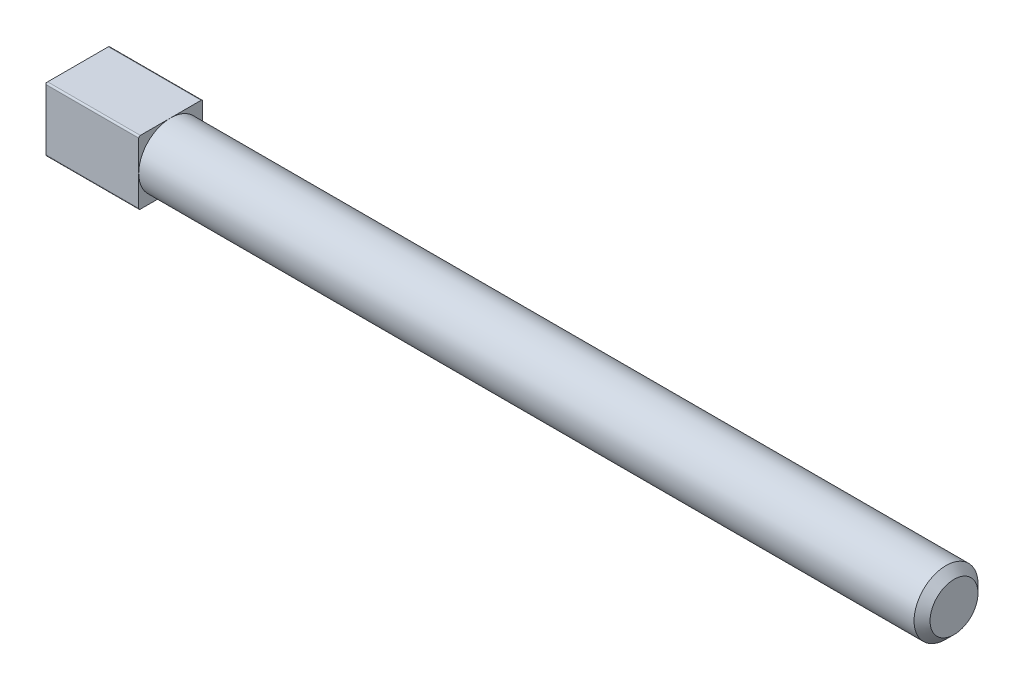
ISO-10303-21;
HEADER;
FILE_DESCRIPTION(('STEP AP214'),'2;1');
FILE_NAME('part.step','',(''),(''),'','','');
FILE_SCHEMA(('AUTOMOTIVE_DESIGN { 1 0 10303 214 1 1 1 1 }'));
ENDSEC;
DATA;
#1=APPLICATION_CONTEXT('core data for automotive mechanical design processes');
#2=APPLICATION_PROTOCOL_DEFINITION('international standard','automotive_design',2000,#1);
#3=PRODUCT_CONTEXT('',#1,'mechanical');
#4=PRODUCT('Part','Part','',(#3));
#5=PRODUCT_RELATED_PRODUCT_CATEGORY('part','',(#4));
#6=PRODUCT_DEFINITION_FORMATION('','',#4);
#7=PRODUCT_DEFINITION_CONTEXT('part definition',#1,'design');
#8=PRODUCT_DEFINITION('design','',#6,#7);
#9=PRODUCT_DEFINITION_SHAPE('','',#8);
#10=(LENGTH_UNIT() NAMED_UNIT(*) SI_UNIT(.MILLI.,.METRE.));
#11=(NAMED_UNIT(*) PLANE_ANGLE_UNIT() SI_UNIT($,.RADIAN.));
#12=(NAMED_UNIT(*) SI_UNIT($,.STERADIAN.) SOLID_ANGLE_UNIT());
#13=UNCERTAINTY_MEASURE_WITH_UNIT(LENGTH_MEASURE(1.E-05),#10,'distance_accuracy_value','');
#14=(GEOMETRIC_REPRESENTATION_CONTEXT(3) GLOBAL_UNCERTAINTY_ASSIGNED_CONTEXT((#13)) GLOBAL_UNIT_ASSIGNED_CONTEXT((#10,
#11,#12)) REPRESENTATION_CONTEXT('',''));
#15=CARTESIAN_POINT('',(0.,0.,0.));
#16=DIRECTION('',(0.,0.,1.));
#17=DIRECTION('',(1.,0.,0.));
#18=AXIS2_PLACEMENT_3D('',#15,#16,#17);
#19=CARTESIAN_POINT('',(6.,0.,0.));
#20=DIRECTION('',(-1.,0.,0.));
#21=DIRECTION('',(0.,0.,1.));
#22=AXIS2_PLACEMENT_3D('',#19,#20,#21);
#23=PLANE('',#22);
#24=DIRECTION('',(0.,1.,0.));
#25=VECTOR('',#24,1.);
#26=CARTESIAN_POINT('',(6.,-2.,-2.));
#27=LINE('',#26,#25);
#28=CARTESIAN_POINT('',(6.,0.,-2.));
#29=VERTEX_POINT('',#28);
#30=CARTESIAN_POINT('',(6.,1.9,-2.));
#31=VERTEX_POINT('',#30);
#32=EDGE_CURVE('E149',#29,#31,#27,.T.);
#33=ORIENTED_EDGE('',*,*,#32,.T.);
#34=CARTESIAN_POINT('',(6.,1.9,-1.9));
#35=DIRECTION('',(-1.,0.,0.));
#36=DIRECTION('',(0.,0.,1.));
#37=AXIS2_PLACEMENT_3D('',#34,#35,#36);
#38=CIRCLE('',#37,0.1);
#39=CARTESIAN_POINT('',(6.,2.,-1.9));
#40=VERTEX_POINT('',#39);
#41=EDGE_CURVE('E232',#31,#40,#38,.F.);
#42=ORIENTED_EDGE('',*,*,#41,.T.);
#43=DIRECTION('',(0.,0.,1.));
#44=VECTOR('',#43,1.);
#45=CARTESIAN_POINT('',(6.,2.,-2.));
#46=LINE('',#45,#44);
#47=CARTESIAN_POINT('',(6.,2.,0.));
#48=VERTEX_POINT('',#47);
#49=EDGE_CURVE('E163',#40,#48,#46,.T.);
#50=ORIENTED_EDGE('',*,*,#49,.T.);
#51=CARTESIAN_POINT('',(6.,0.,0.));
#52=DIRECTION('',(1.,0.,0.));
#53=DIRECTION('',(0.,0.,-1.));
#54=AXIS2_PLACEMENT_3D('',#51,#52,#53);
#55=CIRCLE('',#54,2.);
#56=EDGE_CURVE('E161',#29,#48,#55,.T.);
#57=ORIENTED_EDGE('',*,*,#56,.F.);
#58=EDGE_LOOP('',(#33,#42,#50,#57));
#59=FACE_BOUND('',#58,.T.);
#60=ADVANCED_FACE('F34',(#59),#23,.F.);
#61=CARTESIAN_POINT('',(6.,2.,1.9));
#62=VERTEX_POINT('',#61);
#63=EDGE_CURVE('E148',#48,#62,#46,.T.);
#64=ORIENTED_EDGE('',*,*,#63,.T.);
#65=CARTESIAN_POINT('',(6.,1.9,1.9));
#66=DIRECTION('',(-1.,0.,0.));
#67=DIRECTION('',(0.,0.,1.));
#68=AXIS2_PLACEMENT_3D('',#65,#66,#67);
#69=CIRCLE('',#68,0.1);
#70=CARTESIAN_POINT('',(6.,1.9,2.));
#71=VERTEX_POINT('',#70);
#72=EDGE_CURVE('E11',#62,#71,#69,.F.);
#73=ORIENTED_EDGE('',*,*,#72,.T.);
#74=DIRECTION('',(0.,-1.,0.));
#75=VECTOR('',#74,1.);
#76=CARTESIAN_POINT('',(6.,-2.,2.));
#77=LINE('',#76,#75);
#78=CARTESIAN_POINT('',(6.,0.,2.));
#79=VERTEX_POINT('',#78);
#80=EDGE_CURVE('E175',#71,#79,#77,.T.);
#81=ORIENTED_EDGE('',*,*,#80,.T.);
#82=EDGE_CURVE('E170',#48,#79,#55,.T.);
#83=ORIENTED_EDGE('',*,*,#82,.F.);
#84=EDGE_LOOP('',(#64,#73,#81,#83));
#85=FACE_BOUND('',#84,.T.);
#86=ADVANCED_FACE('F293',(#85),#23,.F.);
#87=CARTESIAN_POINT('',(6.,-1.9,2.));
#88=VERTEX_POINT('',#87);
#89=EDGE_CURVE('E176',#79,#88,#77,.T.);
#90=ORIENTED_EDGE('',*,*,#89,.T.);
#91=CARTESIAN_POINT('',(6.,-1.9,1.9));
#92=DIRECTION('',(-1.,0.,0.));
#93=DIRECTION('',(0.,0.,1.));
#94=AXIS2_PLACEMENT_3D('',#91,#92,#93);
#95=CIRCLE('',#94,0.1);
#96=CARTESIAN_POINT('',(6.,-2.,1.9));
#97=VERTEX_POINT('',#96);
#98=EDGE_CURVE('E42',#88,#97,#95,.F.);
#99=ORIENTED_EDGE('',*,*,#98,.T.);
#100=DIRECTION('',(0.,0.,-1.));
#101=VECTOR('',#100,1.);
#102=CARTESIAN_POINT('',(6.,-2.,-2.));
#103=LINE('',#102,#101);
#104=CARTESIAN_POINT('',(6.,-2.,0.));
#105=VERTEX_POINT('',#104);
#106=EDGE_CURVE('E159',#97,#105,#103,.T.);
#107=ORIENTED_EDGE('',*,*,#106,.T.);
#108=EDGE_CURVE('E174',#79,#105,#55,.T.);
#109=ORIENTED_EDGE('',*,*,#108,.F.);
#110=EDGE_LOOP('',(#90,#99,#107,#109));
#111=FACE_BOUND('',#110,.T.);
#112=ADVANCED_FACE('F254',(#111),#23,.F.);
#113=CARTESIAN_POINT('',(6.,-2.,-1.9));
#114=VERTEX_POINT('',#113);
#115=EDGE_CURVE('E167',#105,#114,#103,.T.);
#116=ORIENTED_EDGE('',*,*,#115,.T.);
#117=CARTESIAN_POINT('',(6.,-1.9,-1.9));
#118=DIRECTION('',(-1.,0.,0.));
#119=DIRECTION('',(0.,0.,1.));
#120=AXIS2_PLACEMENT_3D('',#117,#118,#119);
#121=CIRCLE('',#120,0.1);
#122=CARTESIAN_POINT('',(6.,-1.9,-2.));
#123=VERTEX_POINT('',#122);
#124=EDGE_CURVE('E144',#114,#123,#121,.F.);
#125=ORIENTED_EDGE('',*,*,#124,.T.);
#126=EDGE_CURVE('E136',#123,#29,#27,.T.);
#127=ORIENTED_EDGE('',*,*,#126,.T.);
#128=EDGE_CURVE('E141',#105,#29,#55,.T.);
#129=ORIENTED_EDGE('',*,*,#128,.F.);
#130=EDGE_LOOP('',(#116,#125,#127,#129));
#131=FACE_BOUND('',#130,.T.);
#132=ADVANCED_FACE('F139',(#131),#23,.F.);
#133=CARTESIAN_POINT('',(6.,-2.,-2.));
#134=DIRECTION('',(0.,1.,0.));
#135=DIRECTION('',(0.,0.,1.));
#136=AXIS2_PLACEMENT_3D('',#133,#134,#135);
#137=PLANE('',#136);
#138=DIRECTION('',(0.,0.,-1.));
#139=VECTOR('',#138,1.);
#140=CARTESIAN_POINT('',(0.199999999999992,-2.,-2.));
#141=LINE('',#140,#139);
#142=CARTESIAN_POINT('',(0.199999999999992,-2.,1.9));
#143=VERTEX_POINT('',#142);
#144=CARTESIAN_POINT('',(0.199999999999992,-2.,-1.9));
#145=VERTEX_POINT('',#144);
#146=EDGE_CURVE('E204',#143,#145,#141,.T.);
#147=ORIENTED_EDGE('',*,*,#146,.T.);
#148=DIRECTION('',(-1.,0.,0.));
#149=VECTOR('',#148,1.);
#150=CARTESIAN_POINT('',(6.,-2.,-1.9));
#151=LINE('',#150,#149);
#152=EDGE_CURVE('E241',#145,#114,#151,.F.);
#153=ORIENTED_EDGE('',*,*,#152,.T.);
#154=ORIENTED_EDGE('',*,*,#115,.F.);
#155=ORIENTED_EDGE('',*,*,#106,.F.);
#156=DIRECTION('',(-1.,0.,0.));
#157=VECTOR('',#156,1.);
#158=CARTESIAN_POINT('',(6.,-2.,1.9));
#159=LINE('',#158,#157);
#160=EDGE_CURVE('E238',#97,#143,#159,.T.);
#161=ORIENTED_EDGE('',*,*,#160,.T.);
#162=EDGE_LOOP('',(#147,#153,#154,#155,#161));
#163=FACE_BOUND('',#162,.T.);
#164=ADVANCED_FACE('F258',(#163),#137,.F.);
#165=CARTESIAN_POINT('',(6.,-2.,-2.));
#166=DIRECTION('',(0.,0.,1.));
#167=DIRECTION('',(0.,-1.,0.));
#168=AXIS2_PLACEMENT_3D('',#165,#166,#167);
#169=PLANE('',#168);
#170=DIRECTION('',(0.,1.,0.));
#171=VECTOR('',#170,1.);
#172=CARTESIAN_POINT('',(0.199999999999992,2.,-2.));
#173=LINE('',#172,#171);
#174=CARTESIAN_POINT('',(0.199999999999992,-1.9,-2.));
#175=VERTEX_POINT('',#174);
#176=CARTESIAN_POINT('',(0.199999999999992,1.9,-2.));
#177=VERTEX_POINT('',#176);
#178=EDGE_CURVE('E187',#175,#177,#173,.T.);
#179=ORIENTED_EDGE('',*,*,#178,.T.);
#180=DIRECTION('',(-1.,0.,0.));
#181=VECTOR('',#180,1.);
#182=CARTESIAN_POINT('',(6.,1.9,-2.));
#183=LINE('',#182,#181);
#184=EDGE_CURVE('E156',#177,#31,#183,.F.);
#185=ORIENTED_EDGE('',*,*,#184,.T.);
#186=ORIENTED_EDGE('',*,*,#32,.F.);
#187=ORIENTED_EDGE('',*,*,#126,.F.);
#188=DIRECTION('',(-1.,0.,0.));
#189=VECTOR('',#188,1.);
#190=CARTESIAN_POINT('',(6.,-1.9,-2.));
#191=LINE('',#190,#189);
#192=EDGE_CURVE('E229',#123,#175,#191,.T.);
#193=ORIENTED_EDGE('',*,*,#192,.T.);
#194=EDGE_LOOP('',(#179,#185,#186,#187,#193));
#195=FACE_BOUND('',#194,.T.);
#196=ADVANCED_FACE('F154',(#195),#169,.F.);
#197=CARTESIAN_POINT('',(6.,2.,-2.));
#198=DIRECTION('',(0.,-1.,0.));
#199=DIRECTION('',(0.,0.,-1.));
#200=AXIS2_PLACEMENT_3D('',#197,#198,#199);
#201=PLANE('',#200);
#202=ORIENTED_EDGE('',*,*,#49,.F.);
#203=DIRECTION('',(-1.,0.,0.));
#204=VECTOR('',#203,1.);
#205=CARTESIAN_POINT('',(6.,2.,-1.9));
#206=LINE('',#205,#204);
#207=CARTESIAN_POINT('',(0.199999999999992,2.,-1.9));
#208=VERTEX_POINT('',#207);
#209=EDGE_CURVE('E218',#40,#208,#206,.T.);
#210=ORIENTED_EDGE('',*,*,#209,.T.);
#211=DIRECTION('',(0.,0.,1.));
#212=VECTOR('',#211,1.);
#213=CARTESIAN_POINT('',(0.199999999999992,2.,2.));
#214=LINE('',#213,#212);
#215=CARTESIAN_POINT('',(0.199999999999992,2.,1.9));
#216=VERTEX_POINT('',#215);
#217=EDGE_CURVE('E199',#208,#216,#214,.T.);
#218=ORIENTED_EDGE('',*,*,#217,.T.);
#219=DIRECTION('',(-1.,0.,0.));
#220=VECTOR('',#219,1.);
#221=CARTESIAN_POINT('',(6.,2.,1.9));
#222=LINE('',#221,#220);
#223=EDGE_CURVE('E207',#216,#62,#222,.F.);
#224=ORIENTED_EDGE('',*,*,#223,.T.);
#225=ORIENTED_EDGE('',*,*,#63,.F.);
#226=EDGE_LOOP('',(#202,#210,#218,#224,#225));
#227=FACE_BOUND('',#226,.T.);
#228=ADVANCED_FACE('F290',(#227),#201,.F.);
#229=CARTESIAN_POINT('',(6.,-2.,2.));
#230=DIRECTION('',(0.,0.,-1.));
#231=DIRECTION('',(-1.,0.,0.));
#232=AXIS2_PLACEMENT_3D('',#229,#230,#231);
#233=PLANE('',#232);
#234=DIRECTION('',(0.,-1.,0.));
#235=VECTOR('',#234,1.);
#236=CARTESIAN_POINT('',(0.199999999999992,-2.,2.));
#237=LINE('',#236,#235);
#238=CARTESIAN_POINT('',(0.199999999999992,1.9,2.));
#239=VERTEX_POINT('',#238);
#240=CARTESIAN_POINT('',(0.199999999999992,-1.9,2.));
#241=VERTEX_POINT('',#240);
#242=EDGE_CURVE('E202',#239,#241,#237,.T.);
#243=ORIENTED_EDGE('',*,*,#242,.T.);
#244=DIRECTION('',(-1.,0.,0.));
#245=VECTOR('',#244,1.);
#246=CARTESIAN_POINT('',(6.,-1.9,2.));
#247=LINE('',#246,#245);
#248=EDGE_CURVE('E55',#241,#88,#247,.F.);
#249=ORIENTED_EDGE('',*,*,#248,.T.);
#250=ORIENTED_EDGE('',*,*,#89,.F.);
#251=ORIENTED_EDGE('',*,*,#80,.F.);
#252=DIRECTION('',(-1.,0.,0.));
#253=VECTOR('',#252,1.);
#254=CARTESIAN_POINT('',(6.,1.9,2.));
#255=LINE('',#254,#253);
#256=EDGE_CURVE('E248',#71,#239,#255,.T.);
#257=ORIENTED_EDGE('',*,*,#256,.T.);
#258=EDGE_LOOP('',(#243,#249,#250,#251,#257));
#259=FACE_BOUND('',#258,.T.);
#260=ADVANCED_FACE('F297',(#259),#233,.F.);
#261=CARTESIAN_POINT('',(0.,0.,0.));
#262=DIRECTION('',(-1.,0.,0.));
#263=DIRECTION('',(0.,0.,1.));
#264=AXIS2_PLACEMENT_3D('',#261,#262,#263);
#265=PLANE('',#264);
#266=DIRECTION('',(0.,0.,-1.));
#267=VECTOR('',#266,1.);
#268=CARTESIAN_POINT('',(0.,1.80000000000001,-2.));
#269=LINE('',#268,#267);
#270=CARTESIAN_POINT('',(0.,1.80000000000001,1.80000000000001));
#271=VERTEX_POINT('',#270);
#272=CARTESIAN_POINT('',(0.,1.80000000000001,-1.80000000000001));
#273=VERTEX_POINT('',#272);
#274=EDGE_CURVE('E194',#271,#273,#269,.T.);
#275=ORIENTED_EDGE('',*,*,#274,.T.);
#276=DIRECTION('',(0.,-1.,0.));
#277=VECTOR('',#276,1.);
#278=CARTESIAN_POINT('',(0.,-2.,-1.80000000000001));
#279=LINE('',#278,#277);
#280=CARTESIAN_POINT('',(0.,-1.80000000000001,-1.80000000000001));
#281=VERTEX_POINT('',#280);
#282=EDGE_CURVE('E196',#273,#281,#279,.T.);
#283=ORIENTED_EDGE('',*,*,#282,.T.);
#284=DIRECTION('',(0.,0.,1.));
#285=VECTOR('',#284,1.);
#286=CARTESIAN_POINT('',(0.,-1.80000000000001,2.));
#287=LINE('',#286,#285);
#288=CARTESIAN_POINT('',(0.,-1.80000000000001,1.80000000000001));
#289=VERTEX_POINT('',#288);
#290=EDGE_CURVE('E189',#281,#289,#287,.T.);
#291=ORIENTED_EDGE('',*,*,#290,.T.);
#292=DIRECTION('',(0.,1.,0.));
#293=VECTOR('',#292,1.);
#294=CARTESIAN_POINT('',(0.,2.,1.80000000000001));
#295=LINE('',#294,#293);
#296=EDGE_CURVE('E192',#289,#271,#295,.T.);
#297=ORIENTED_EDGE('',*,*,#296,.T.);
#298=EDGE_LOOP('',(#275,#283,#291,#297));
#299=FACE_BOUND('',#298,.T.);
#300=ADVANCED_FACE('F274',(#299),#265,.T.);
#301=CARTESIAN_POINT('',(55.,0.,0.));
#302=DIRECTION('',(-1.,0.,0.));
#303=DIRECTION('',(0.,0.,1.));
#304=AXIS2_PLACEMENT_3D('',#301,#302,#303);
#305=CYLINDRICAL_SURFACE('',#304,2.);
#306=CARTESIAN_POINT('',(54.5,0.,0.));
#307=DIRECTION('',(1.,0.,0.));
#308=DIRECTION('',(0.,0.,-1.));
#309=AXIS2_PLACEMENT_3D('',#306,#307,#308);
#310=CIRCLE('',#309,2.);
#311=CARTESIAN_POINT('',(54.5,0.,-2.));
#312=VERTEX_POINT('',#311);
#313=EDGE_CURVE('E184',#312,#312,#310,.F.);
#314=ORIENTED_EDGE('',*,*,#313,.T.);
#315=EDGE_LOOP('',(#314));
#316=FACE_BOUND('',#315,.T.);
#317=ORIENTED_EDGE('',*,*,#56,.T.);
#318=ORIENTED_EDGE('',*,*,#82,.T.);
#319=ORIENTED_EDGE('',*,*,#108,.T.);
#320=ORIENTED_EDGE('',*,*,#128,.T.);
#321=EDGE_LOOP('',(#317,#318,#319,#320));
#322=FACE_BOUND('',#321,.T.);
#323=ADVANCED_FACE('F172',(#316,#322),#305,.T.);
#324=CARTESIAN_POINT('',(55.,0.,0.));
#325=DIRECTION('',(1.,0.,0.));
#326=DIRECTION('',(0.,0.,-1.));
#327=AXIS2_PLACEMENT_3D('',#324,#325,#326);
#328=PLANE('',#327);
#329=CARTESIAN_POINT('',(55.,0.,0.));
#330=DIRECTION('',(1.,0.,0.));
#331=DIRECTION('',(0.,0.,-1.));
#332=AXIS2_PLACEMENT_3D('',#329,#330,#331);
#333=CIRCLE('',#332,1.49999999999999);
#334=CARTESIAN_POINT('',(55.,0.,-1.49999999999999));
#335=VERTEX_POINT('',#334);
#336=EDGE_CURVE('E181',#335,#335,#333,.T.);
#337=ORIENTED_EDGE('',*,*,#336,.T.);
#338=EDGE_LOOP('',(#337));
#339=FACE_BOUND('',#338,.T.);
#340=ADVANCED_FACE('F353',(#339),#328,.T.);
#341=CARTESIAN_POINT('',(55.,0.,0.));
#342=DIRECTION('',(-1.,0.,0.));
#343=DIRECTION('',(0.,0.,1.));
#344=AXIS2_PLACEMENT_3D('',#341,#342,#343);
#345=CONICAL_SURFACE('',#344,1.49999999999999,0.785398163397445);
#346=ORIENTED_EDGE('',*,*,#313,.F.);
#347=EDGE_LOOP('',(#346));
#348=FACE_BOUND('',#347,.T.);
#349=ORIENTED_EDGE('',*,*,#336,.F.);
#350=EDGE_LOOP('',(#349));
#351=FACE_BOUND('',#350,.T.);
#352=ADVANCED_FACE('F348',(#348,#351),#345,.T.);
#353=CARTESIAN_POINT('',(0.199999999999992,-2.,2.));
#354=DIRECTION('',(-0.707106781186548,0.,0.707106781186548));
#355=DIRECTION('',(0.,1.,0.));
#356=AXIS2_PLACEMENT_3D('',#353,#354,#355);
#357=PLANE('',#356);
#358=DIRECTION('',(-0.577350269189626,0.577350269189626,-0.577350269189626));
#359=VECTOR('',#358,1.);
#360=CARTESIAN_POINT('',(-1.13333333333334,-0.666666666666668,0.666666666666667));
#361=LINE('',#360,#359);
#362=CARTESIAN_POINT('',(0.170710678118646,-1.97071067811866,1.97071067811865));
#363=VERTEX_POINT('',#362);
#364=EDGE_CURVE('E168',#363,#289,#361,.T.);
#365=ORIENTED_EDGE('',*,*,#364,.F.);
#366=CARTESIAN_POINT('',(0.0999999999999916,-1.9,1.9));
#367=DIRECTION('',(-0.707106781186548,0.,0.707106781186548));
#368=DIRECTION('',(-0.707106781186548,0.,-0.707106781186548));
#369=AXIS2_PLACEMENT_3D('',#366,#367,#368);
#370=ELLIPSE('',#369,0.14142135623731,0.1);
#371=EDGE_CURVE('E246',#363,#241,#370,.T.);
#372=ORIENTED_EDGE('',*,*,#371,.T.);
#373=ORIENTED_EDGE('',*,*,#242,.F.);
#374=CARTESIAN_POINT('',(0.0999999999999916,1.9,1.9));
#375=DIRECTION('',(-0.707106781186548,0.,0.707106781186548));
#376=DIRECTION('',(-0.707106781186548,0.,-0.707106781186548));
#377=AXIS2_PLACEMENT_3D('',#374,#375,#376);
#378=ELLIPSE('',#377,0.14142135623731,0.1);
#379=CARTESIAN_POINT('',(0.170710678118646,1.97071067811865,1.97071067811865));
#380=VERTEX_POINT('',#379);
#381=EDGE_CURVE('E244',#239,#380,#378,.T.);
#382=ORIENTED_EDGE('',*,*,#381,.T.);
#383=DIRECTION('',(-0.577350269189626,-0.577350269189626,-0.577350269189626));
#384=VECTOR('',#383,1.);
#385=CARTESIAN_POINT('',(-1.13333333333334,0.666666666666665,0.666666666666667));
#386=LINE('',#385,#384);
#387=EDGE_CURVE('E213',#271,#380,#386,.F.);
#388=ORIENTED_EDGE('',*,*,#387,.F.);
#389=ORIENTED_EDGE('',*,*,#296,.F.);
#390=EDGE_LOOP('',(#365,#372,#373,#382,#388,#389));
#391=FACE_BOUND('',#390,.T.);
#392=ADVANCED_FACE('F269',(#391),#357,.T.);
#393=CARTESIAN_POINT('',(0.199999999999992,-2.,-2.));
#394=DIRECTION('',(-0.707106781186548,-0.707106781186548,0.));
#395=DIRECTION('',(0.,0.,1.));
#396=AXIS2_PLACEMENT_3D('',#393,#394,#395);
#397=PLANE('',#396);
#398=DIRECTION('',(0.577350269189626,-0.577350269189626,-0.577350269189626));
#399=VECTOR('',#398,1.);
#400=CARTESIAN_POINT('',(0.199999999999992,-2.,-2.));
#401=LINE('',#400,#399);
#402=CARTESIAN_POINT('',(0.170710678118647,-1.97071067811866,-1.97071067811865));
#403=VERTEX_POINT('',#402);
#404=EDGE_CURVE('E211',#403,#281,#401,.F.);
#405=ORIENTED_EDGE('',*,*,#404,.F.);
#406=CARTESIAN_POINT('',(0.0999999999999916,-1.9,-1.9));
#407=DIRECTION('',(-0.707106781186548,-0.707106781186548,0.));
#408=DIRECTION('',(-0.707106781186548,0.707106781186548,0.));
#409=AXIS2_PLACEMENT_3D('',#406,#407,#408);
#410=ELLIPSE('',#409,0.14142135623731,0.1);
#411=EDGE_CURVE('E236',#403,#145,#410,.T.);
#412=ORIENTED_EDGE('',*,*,#411,.T.);
#413=ORIENTED_EDGE('',*,*,#146,.F.);
#414=CARTESIAN_POINT('',(0.0999999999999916,-1.9,1.9));
#415=DIRECTION('',(-0.707106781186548,-0.707106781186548,0.));
#416=DIRECTION('',(-0.707106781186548,0.707106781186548,0.));
#417=AXIS2_PLACEMENT_3D('',#414,#415,#416);
#418=ELLIPSE('',#417,0.14142135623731,0.1);
#419=EDGE_CURVE('E234',#143,#363,#418,.T.);
#420=ORIENTED_EDGE('',*,*,#419,.T.);
#421=ORIENTED_EDGE('',*,*,#364,.T.);
#422=ORIENTED_EDGE('',*,*,#290,.F.);
#423=EDGE_LOOP('',(#405,#412,#413,#420,#421,#422));
#424=FACE_BOUND('',#423,.T.);
#425=ADVANCED_FACE('F265',(#424),#397,.T.);
#426=CARTESIAN_POINT('',(0.199999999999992,2.,-2.));
#427=DIRECTION('',(-0.707106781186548,0.707106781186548,0.));
#428=DIRECTION('',(0.,0.,-1.));
#429=AXIS2_PLACEMENT_3D('',#426,#427,#428);
#430=PLANE('',#429);
#431=ORIENTED_EDGE('',*,*,#217,.F.);
#432=CARTESIAN_POINT('',(0.0999999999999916,1.9,-1.9));
#433=DIRECTION('',(-0.707106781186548,0.707106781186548,0.));
#434=DIRECTION('',(-0.707106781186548,-0.707106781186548,0.));
#435=AXIS2_PLACEMENT_3D('',#432,#433,#434);
#436=ELLIPSE('',#435,0.14142135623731,0.1);
#437=CARTESIAN_POINT('',(0.170710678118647,1.97071067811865,-1.97071067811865));
#438=VERTEX_POINT('',#437);
#439=EDGE_CURVE('E223',#208,#438,#436,.T.);
#440=ORIENTED_EDGE('',*,*,#439,.T.);
#441=DIRECTION('',(-0.577350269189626,-0.577350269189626,0.577350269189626));
#442=VECTOR('',#441,1.);
#443=CARTESIAN_POINT('',(0.199999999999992,2.,-2.));
#444=LINE('',#443,#442);
#445=EDGE_CURVE('E208',#273,#438,#444,.F.);
#446=ORIENTED_EDGE('',*,*,#445,.F.);
#447=ORIENTED_EDGE('',*,*,#274,.F.);
#448=ORIENTED_EDGE('',*,*,#387,.T.);
#449=CARTESIAN_POINT('',(0.0999999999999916,1.9,1.9));
#450=DIRECTION('',(-0.707106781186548,0.707106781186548,0.));
#451=DIRECTION('',(-0.707106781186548,-0.707106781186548,0.));
#452=AXIS2_PLACEMENT_3D('',#449,#450,#451);
#453=ELLIPSE('',#452,0.14142135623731,0.1);
#454=EDGE_CURVE('E221',#380,#216,#453,.T.);
#455=ORIENTED_EDGE('',*,*,#454,.T.);
#456=EDGE_LOOP('',(#431,#440,#446,#447,#448,#455));
#457=FACE_BOUND('',#456,.T.);
#458=ADVANCED_FACE('F299',(#457),#430,.T.);
#459=CARTESIAN_POINT('',(0.199999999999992,-2.,-2.));
#460=DIRECTION('',(-0.707106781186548,0.,-0.707106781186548));
#461=DIRECTION('',(0.,-1.,0.));
#462=AXIS2_PLACEMENT_3D('',#459,#460,#461);
#463=PLANE('',#462);
#464=ORIENTED_EDGE('',*,*,#445,.T.);
#465=CARTESIAN_POINT('',(0.0999999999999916,1.9,-1.9));
#466=DIRECTION('',(-0.707106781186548,0.,-0.707106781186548));
#467=DIRECTION('',(-0.707106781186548,0.,0.707106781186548));
#468=AXIS2_PLACEMENT_3D('',#465,#466,#467);
#469=ELLIPSE('',#468,0.14142135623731,0.1);
#470=EDGE_CURVE('E227',#438,#177,#469,.T.);
#471=ORIENTED_EDGE('',*,*,#470,.T.);
#472=ORIENTED_EDGE('',*,*,#178,.F.);
#473=CARTESIAN_POINT('',(0.0999999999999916,-1.9,-1.9));
#474=DIRECTION('',(-0.707106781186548,0.,-0.707106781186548));
#475=DIRECTION('',(-0.707106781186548,0.,0.707106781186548));
#476=AXIS2_PLACEMENT_3D('',#473,#474,#475);
#477=ELLIPSE('',#476,0.14142135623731,0.1);
#478=EDGE_CURVE('E225',#175,#403,#477,.T.);
#479=ORIENTED_EDGE('',*,*,#478,.T.);
#480=ORIENTED_EDGE('',*,*,#404,.T.);
#481=ORIENTED_EDGE('',*,*,#282,.F.);
#482=EDGE_LOOP('',(#464,#471,#472,#479,#480,#481));
#483=FACE_BOUND('',#482,.T.);
#484=ADVANCED_FACE('F282',(#483),#463,.T.);
#485=CARTESIAN_POINT('',(6.,1.9,-1.9));
#486=DIRECTION('',(-1.,0.,0.));
#487=DIRECTION('',(0.,0.,1.));
#488=AXIS2_PLACEMENT_3D('',#485,#486,#487);
#489=CYLINDRICAL_SURFACE('',#488,0.1);
#490=ORIENTED_EDGE('',*,*,#41,.F.);
#491=ORIENTED_EDGE('',*,*,#184,.F.);
#492=ORIENTED_EDGE('',*,*,#470,.F.);
#493=ORIENTED_EDGE('',*,*,#439,.F.);
#494=ORIENTED_EDGE('',*,*,#209,.F.);
#495=EDGE_LOOP('',(#490,#491,#492,#493,#494));
#496=FACE_BOUND('',#495,.T.);
#497=ADVANCED_FACE('F286',(#496),#489,.T.);
#498=CARTESIAN_POINT('',(6.,-1.9,-1.9));
#499=DIRECTION('',(-1.,0.,0.));
#500=DIRECTION('',(0.,0.,1.));
#501=AXIS2_PLACEMENT_3D('',#498,#499,#500);
#502=CYLINDRICAL_SURFACE('',#501,0.1);
#503=ORIENTED_EDGE('',*,*,#124,.F.);
#504=ORIENTED_EDGE('',*,*,#152,.F.);
#505=ORIENTED_EDGE('',*,*,#411,.F.);
#506=ORIENTED_EDGE('',*,*,#478,.F.);
#507=ORIENTED_EDGE('',*,*,#192,.F.);
#508=EDGE_LOOP('',(#503,#504,#505,#506,#507));
#509=FACE_BOUND('',#508,.T.);
#510=ADVANCED_FACE('F280',(#509),#502,.T.);
#511=CARTESIAN_POINT('',(6.,-1.9,1.9));
#512=DIRECTION('',(-1.,0.,0.));
#513=DIRECTION('',(0.,0.,1.));
#514=AXIS2_PLACEMENT_3D('',#511,#512,#513);
#515=CYLINDRICAL_SURFACE('',#514,0.1);
#516=ORIENTED_EDGE('',*,*,#98,.F.);
#517=ORIENTED_EDGE('',*,*,#248,.F.);
#518=ORIENTED_EDGE('',*,*,#371,.F.);
#519=ORIENTED_EDGE('',*,*,#419,.F.);
#520=ORIENTED_EDGE('',*,*,#160,.F.);
#521=EDGE_LOOP('',(#516,#517,#518,#519,#520));
#522=FACE_BOUND('',#521,.T.);
#523=ADVANCED_FACE('F260',(#522),#515,.T.);
#524=CARTESIAN_POINT('',(6.,1.9,1.9));
#525=DIRECTION('',(-1.,0.,0.));
#526=DIRECTION('',(0.,0.,1.));
#527=AXIS2_PLACEMENT_3D('',#524,#525,#526);
#528=CYLINDRICAL_SURFACE('',#527,0.1);
#529=ORIENTED_EDGE('',*,*,#72,.F.);
#530=ORIENTED_EDGE('',*,*,#223,.F.);
#531=ORIENTED_EDGE('',*,*,#454,.F.);
#532=ORIENTED_EDGE('',*,*,#381,.F.);
#533=ORIENTED_EDGE('',*,*,#256,.F.);
#534=EDGE_LOOP('',(#529,#530,#531,#532,#533));
#535=FACE_BOUND('',#534,.T.);
#536=ADVANCED_FACE('F36',(#535),#528,.T.);
#537=CLOSED_SHELL('',(#60,#86,#112,#132,#164,#196,#228,#260,#300,#323,#340,#352,#392,#425,#458,
#484,#497,#510,#523,#536));
#538=MANIFOLD_SOLID_BREP('B2',#537);
#539=ADVANCED_BREP_SHAPE_REPRESENTATION('',(#18,#538),#14);
#540=SHAPE_DEFINITION_REPRESENTATION(#9,#539);
ENDSEC;
END-ISO-10303-21;
